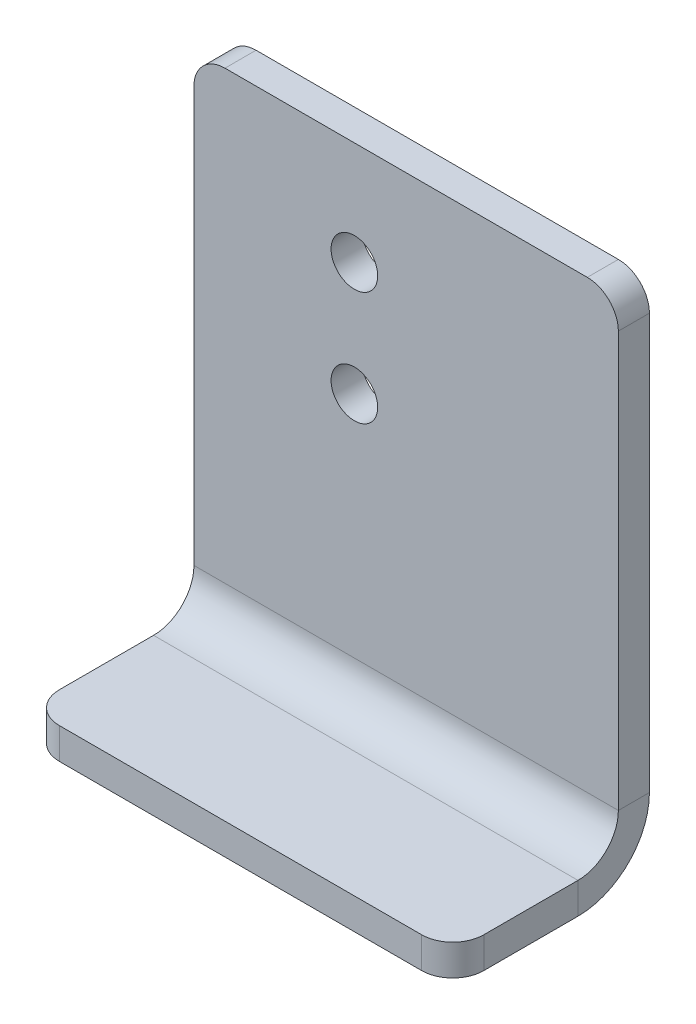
ISO-10303-21;
HEADER;
FILE_DESCRIPTION(('STEP AP214'),'2;1');
FILE_NAME('part.step','',(''),(''),'','','');
FILE_SCHEMA(('AUTOMOTIVE_DESIGN { 1 0 10303 214 1 1 1 1 }'));
ENDSEC;
DATA;
#1=APPLICATION_CONTEXT('core data for automotive mechanical design processes');
#2=APPLICATION_PROTOCOL_DEFINITION('international standard','automotive_design',2000,#1);
#3=PRODUCT_CONTEXT('',#1,'mechanical');
#4=PRODUCT('Part','Part','',(#3));
#5=PRODUCT_RELATED_PRODUCT_CATEGORY('part','',(#4));
#6=PRODUCT_DEFINITION_FORMATION('','',#4);
#7=PRODUCT_DEFINITION_CONTEXT('part definition',#1,'design');
#8=PRODUCT_DEFINITION('design','',#6,#7);
#9=PRODUCT_DEFINITION_SHAPE('','',#8);
#10=(LENGTH_UNIT() NAMED_UNIT(*) SI_UNIT(.MILLI.,.METRE.));
#11=(NAMED_UNIT(*) PLANE_ANGLE_UNIT() SI_UNIT($,.RADIAN.));
#12=(NAMED_UNIT(*) SI_UNIT($,.STERADIAN.) SOLID_ANGLE_UNIT());
#13=UNCERTAINTY_MEASURE_WITH_UNIT(LENGTH_MEASURE(1.E-05),#10,'distance_accuracy_value','');
#14=(GEOMETRIC_REPRESENTATION_CONTEXT(3) GLOBAL_UNCERTAINTY_ASSIGNED_CONTEXT((#13)) GLOBAL_UNIT_ASSIGNED_CONTEXT((#10,
#11,#12)) REPRESENTATION_CONTEXT('',''));
#15=CARTESIAN_POINT('',(0.,0.,0.));
#16=DIRECTION('',(0.,0.,1.));
#17=DIRECTION('',(1.,0.,0.));
#18=AXIS2_PLACEMENT_3D('',#15,#16,#17);
#19=CARTESIAN_POINT('',(20.5,-25.,-3.));
#20=DIRECTION('',(1.,0.,0.));
#21=DIRECTION('',(0.,0.,-1.));
#22=AXIS2_PLACEMENT_3D('',#19,#20,#21);
#23=PLANE('',#22);
#24=DIRECTION('',(0.,1.,0.));
#25=VECTOR('',#24,1.);
#26=CARTESIAN_POINT('',(20.5,-25.,-3.));
#27=LINE('',#26,#25);
#28=CARTESIAN_POINT('',(20.5,-18.1,-3.));
#29=VERTEX_POINT('',#28);
#30=CARTESIAN_POINT('',(20.5,22.,-3.));
#31=VERTEX_POINT('',#30);
#32=EDGE_CURVE('E212',#29,#31,#27,.T.);
#33=ORIENTED_EDGE('',*,*,#32,.T.);
#34=DIRECTION('',(0.,0.,1.));
#35=VECTOR('',#34,1.);
#36=CARTESIAN_POINT('',(20.5,22.,-3.));
#37=LINE('',#36,#35);
#38=CARTESIAN_POINT('',(20.5,22.,0.));
#39=VERTEX_POINT('',#38);
#40=EDGE_CURVE('E13',#31,#39,#37,.T.);
#41=ORIENTED_EDGE('',*,*,#40,.T.);
#42=DIRECTION('',(0.,1.,0.));
#43=VECTOR('',#42,1.);
#44=CARTESIAN_POINT('',(20.5,-25.,0.));
#45=LINE('',#44,#43);
#46=CARTESIAN_POINT('',(20.5,-18.1,0.));
#47=VERTEX_POINT('',#46);
#48=EDGE_CURVE('E221',#47,#39,#45,.T.);
#49=ORIENTED_EDGE('',*,*,#48,.F.);
#50=DIRECTION('',(0.,0.,-1.));
#51=VECTOR('',#50,1.);
#52=CARTESIAN_POINT('',(20.5,-18.1,0.));
#53=LINE('',#52,#51);
#54=EDGE_CURVE('E196',#47,#29,#53,.T.);
#55=ORIENTED_EDGE('',*,*,#54,.T.);
#56=EDGE_LOOP('',(#33,#41,#49,#55));
#57=FACE_BOUND('',#56,.T.);
#58=ADVANCED_FACE('F54',(#57),#23,.T.);
#59=CARTESIAN_POINT('',(0.,0.,-3.));
#60=DIRECTION('',(0.,0.,1.));
#61=DIRECTION('',(1.,0.,0.));
#62=AXIS2_PLACEMENT_3D('',#59,#60,#61);
#63=PLANE('',#62);
#64=CARTESIAN_POINT('',(-5.00000000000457,15.0000000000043,-3.));
#65=DIRECTION('',(0.,0.,-1.));
#66=DIRECTION('',(-1.,0.,0.));
#67=AXIS2_PLACEMENT_3D('',#64,#65,#66);
#68=CIRCLE('',#67,2.25);
#69=CARTESIAN_POINT('',(-7.25000000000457,15.0000000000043,-3.));
#70=VERTEX_POINT('',#69);
#71=EDGE_CURVE('E500',#70,#70,#68,.T.);
#72=ORIENTED_EDGE('',*,*,#71,.F.);
#73=EDGE_LOOP('',(#72));
#74=FACE_BOUND('',#73,.T.);
#75=CARTESIAN_POINT('',(-5.0000000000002,4.,-3.));
#76=DIRECTION('',(0.,0.,-1.));
#77=DIRECTION('',(-1.,0.,0.));
#78=AXIS2_PLACEMENT_3D('',#75,#76,#77);
#79=CIRCLE('',#78,2.25);
#80=CARTESIAN_POINT('',(-7.2500000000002,4.,-3.));
#81=VERTEX_POINT('',#80);
#82=EDGE_CURVE('E501',#81,#81,#79,.T.);
#83=ORIENTED_EDGE('',*,*,#82,.F.);
#84=EDGE_LOOP('',(#83));
#85=FACE_BOUND('',#84,.T.);
#86=DIRECTION('',(0.,-1.,0.));
#87=VECTOR('',#86,1.);
#88=CARTESIAN_POINT('',(-20.5,-25.,-3.));
#89=LINE('',#88,#87);
#90=CARTESIAN_POINT('',(-20.5,22.,-3.));
#91=VERTEX_POINT('',#90);
#92=CARTESIAN_POINT('',(-20.5,-18.1,-3.));
#93=VERTEX_POINT('',#92);
#94=EDGE_CURVE('E210',#91,#93,#89,.T.);
#95=ORIENTED_EDGE('',*,*,#94,.F.);
#96=CARTESIAN_POINT('',(-17.5,22.,-3.));
#97=DIRECTION('',(0.,0.,1.));
#98=DIRECTION('',(1.,0.,0.));
#99=AXIS2_PLACEMENT_3D('',#96,#97,#98);
#100=CIRCLE('',#99,3.);
#101=CARTESIAN_POINT('',(-17.5,25.,-3.));
#102=VERTEX_POINT('',#101);
#103=EDGE_CURVE('E238',#91,#102,#100,.F.);
#104=ORIENTED_EDGE('',*,*,#103,.T.);
#105=DIRECTION('',(-1.,0.,0.));
#106=VECTOR('',#105,1.);
#107=CARTESIAN_POINT('',(20.5,25.,-3.));
#108=LINE('',#107,#106);
#109=CARTESIAN_POINT('',(17.5,25.,-3.));
#110=VERTEX_POINT('',#109);
#111=EDGE_CURVE('E216',#110,#102,#108,.T.);
#112=ORIENTED_EDGE('',*,*,#111,.F.);
#113=CARTESIAN_POINT('',(17.5,22.,-3.));
#114=DIRECTION('',(0.,0.,1.));
#115=DIRECTION('',(1.,0.,0.));
#116=AXIS2_PLACEMENT_3D('',#113,#114,#115);
#117=CIRCLE('',#116,3.);
#118=EDGE_CURVE('E236',#110,#31,#117,.F.);
#119=ORIENTED_EDGE('',*,*,#118,.T.);
#120=ORIENTED_EDGE('',*,*,#32,.F.);
#121=DIRECTION('',(1.,0.,0.));
#122=VECTOR('',#121,1.);
#123=CARTESIAN_POINT('',(20.5,-18.1,-3.));
#124=LINE('',#123,#122);
#125=EDGE_CURVE('E155',#29,#93,#124,.F.);
#126=ORIENTED_EDGE('',*,*,#125,.T.);
#127=EDGE_LOOP('',(#95,#104,#112,#119,#120,#126));
#128=FACE_BOUND('',#127,.T.);
#129=ADVANCED_FACE('F283',(#74,#85,#128),#63,.F.);
#130=CARTESIAN_POINT('',(0.,0.,0.));
#131=DIRECTION('',(0.,0.,1.));
#132=DIRECTION('',(1.,0.,0.));
#133=AXIS2_PLACEMENT_3D('',#130,#131,#132);
#134=PLANE('',#133);
#135=CARTESIAN_POINT('',(-5.00000000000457,15.0000000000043,0.));
#136=DIRECTION('',(0.,0.,1.));
#137=DIRECTION('',(1.,0.,0.));
#138=AXIS2_PLACEMENT_3D('',#135,#136,#137);
#139=CIRCLE('',#138,2.25);
#140=CARTESIAN_POINT('',(-2.75000000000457,15.0000000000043,0.));
#141=VERTEX_POINT('',#140);
#142=EDGE_CURVE('E193',#141,#141,#139,.F.);
#143=ORIENTED_EDGE('',*,*,#142,.T.);
#144=EDGE_LOOP('',(#143));
#145=FACE_BOUND('',#144,.T.);
#146=CARTESIAN_POINT('',(-5.0000000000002,4.,0.));
#147=DIRECTION('',(0.,0.,1.));
#148=DIRECTION('',(1.,0.,0.));
#149=AXIS2_PLACEMENT_3D('',#146,#147,#148);
#150=CIRCLE('',#149,2.25);
#151=CARTESIAN_POINT('',(-2.7500000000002,4.,0.));
#152=VERTEX_POINT('',#151);
#153=EDGE_CURVE('E498',#152,#152,#150,.F.);
#154=ORIENTED_EDGE('',*,*,#153,.T.);
#155=EDGE_LOOP('',(#154));
#156=FACE_BOUND('',#155,.T.);
#157=DIRECTION('',(-1.,0.,0.));
#158=VECTOR('',#157,1.);
#159=CARTESIAN_POINT('',(20.5,25.,0.));
#160=LINE('',#159,#158);
#161=CARTESIAN_POINT('',(17.5,25.,0.));
#162=VERTEX_POINT('',#161);
#163=CARTESIAN_POINT('',(-17.5,25.,0.));
#164=VERTEX_POINT('',#163);
#165=EDGE_CURVE('E213',#162,#164,#160,.T.);
#166=ORIENTED_EDGE('',*,*,#165,.T.);
#167=CARTESIAN_POINT('',(-17.5,22.,0.));
#168=DIRECTION('',(0.,0.,1.));
#169=DIRECTION('',(1.,0.,0.));
#170=AXIS2_PLACEMENT_3D('',#167,#168,#169);
#171=CIRCLE('',#170,3.);
#172=CARTESIAN_POINT('',(-20.5,22.,0.));
#173=VERTEX_POINT('',#172);
#174=EDGE_CURVE('E232',#164,#173,#171,.T.);
#175=ORIENTED_EDGE('',*,*,#174,.T.);
#176=DIRECTION('',(0.,-1.,0.));
#177=VECTOR('',#176,1.);
#178=CARTESIAN_POINT('',(-20.5,-25.,0.));
#179=LINE('',#178,#177);
#180=CARTESIAN_POINT('',(-20.5,-18.1,0.));
#181=VERTEX_POINT('',#180);
#182=EDGE_CURVE('E207',#173,#181,#179,.T.);
#183=ORIENTED_EDGE('',*,*,#182,.T.);
#184=DIRECTION('',(1.,0.,0.));
#185=VECTOR('',#184,1.);
#186=CARTESIAN_POINT('',(20.5,-18.1,0.));
#187=LINE('',#186,#185);
#188=EDGE_CURVE('E200',#47,#181,#187,.F.);
#189=ORIENTED_EDGE('',*,*,#188,.F.);
#190=ORIENTED_EDGE('',*,*,#48,.T.);
#191=CARTESIAN_POINT('',(17.5,22.,0.));
#192=DIRECTION('',(0.,0.,1.));
#193=DIRECTION('',(1.,0.,0.));
#194=AXIS2_PLACEMENT_3D('',#191,#192,#193);
#195=CIRCLE('',#194,3.);
#196=EDGE_CURVE('E230',#39,#162,#195,.T.);
#197=ORIENTED_EDGE('',*,*,#196,.T.);
#198=EDGE_LOOP('',(#166,#175,#183,#189,#190,#197));
#199=FACE_BOUND('',#198,.T.);
#200=ADVANCED_FACE('F290',(#145,#156,#199),#134,.T.);
#201=CARTESIAN_POINT('',(-20.5,-25.,-3.));
#202=DIRECTION('',(-1.,0.,0.));
#203=DIRECTION('',(0.,0.,1.));
#204=AXIS2_PLACEMENT_3D('',#201,#202,#203);
#205=PLANE('',#204);
#206=ORIENTED_EDGE('',*,*,#182,.F.);
#207=DIRECTION('',(0.,0.,1.));
#208=VECTOR('',#207,1.);
#209=CARTESIAN_POINT('',(-20.5,22.,-3.));
#210=LINE('',#209,#208);
#211=EDGE_CURVE('E234',#173,#91,#210,.F.);
#212=ORIENTED_EDGE('',*,*,#211,.T.);
#213=ORIENTED_EDGE('',*,*,#94,.T.);
#214=DIRECTION('',(0.,0.,-1.));
#215=VECTOR('',#214,1.);
#216=CARTESIAN_POINT('',(-20.5,-18.1,0.));
#217=LINE('',#216,#215);
#218=EDGE_CURVE('E204',#181,#93,#217,.T.);
#219=ORIENTED_EDGE('',*,*,#218,.F.);
#220=EDGE_LOOP('',(#206,#212,#213,#219));
#221=FACE_BOUND('',#220,.T.);
#222=ADVANCED_FACE('F278',(#221),#205,.T.);
#223=CARTESIAN_POINT('',(20.5,25.,-3.));
#224=DIRECTION('',(0.,1.,0.));
#225=DIRECTION('',(-1.,0.,0.));
#226=AXIS2_PLACEMENT_3D('',#223,#224,#225);
#227=PLANE('',#226);
#228=ORIENTED_EDGE('',*,*,#111,.T.);
#229=DIRECTION('',(0.,0.,1.));
#230=VECTOR('',#229,1.);
#231=CARTESIAN_POINT('',(-17.5,25.,-3.));
#232=LINE('',#231,#230);
#233=EDGE_CURVE('E227',#102,#164,#232,.T.);
#234=ORIENTED_EDGE('',*,*,#233,.T.);
#235=ORIENTED_EDGE('',*,*,#165,.F.);
#236=DIRECTION('',(0.,0.,1.));
#237=VECTOR('',#236,1.);
#238=CARTESIAN_POINT('',(17.5,25.,-3.));
#239=LINE('',#238,#237);
#240=EDGE_CURVE('E219',#162,#110,#239,.F.);
#241=ORIENTED_EDGE('',*,*,#240,.T.);
#242=EDGE_LOOP('',(#228,#234,#235,#241));
#243=FACE_BOUND('',#242,.T.);
#244=ADVANCED_FACE('F296',(#243),#227,.T.);
#245=CARTESIAN_POINT('',(-20.5,-18.1,3.9));
#246=DIRECTION('',(-1.,0.,0.));
#247=DIRECTION('',(0.,0.,1.));
#248=AXIS2_PLACEMENT_3D('',#245,#246,#247);
#249=PLANE('',#248);
#250=DIRECTION('',(0.,1.,0.));
#251=VECTOR('',#250,1.);
#252=CARTESIAN_POINT('',(-20.5,-25.,3.89999999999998));
#253=LINE('',#252,#251);
#254=CARTESIAN_POINT('',(-20.5,-22.,3.89999999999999));
#255=VERTEX_POINT('',#254);
#256=CARTESIAN_POINT('',(-20.5,-25.,3.89999999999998));
#257=VERTEX_POINT('',#256);
#258=EDGE_CURVE('E190',#255,#257,#253,.F.);
#259=ORIENTED_EDGE('',*,*,#258,.F.);
#260=CARTESIAN_POINT('',(-20.5,-18.1,3.9));
#261=DIRECTION('',(1.,0.,0.));
#262=DIRECTION('',(0.,0.,-1.));
#263=AXIS2_PLACEMENT_3D('',#260,#261,#262);
#264=CIRCLE('',#263,3.9);
#265=EDGE_CURVE('E158',#181,#255,#264,.F.);
#266=ORIENTED_EDGE('',*,*,#265,.F.);
#267=ORIENTED_EDGE('',*,*,#218,.T.);
#268=CARTESIAN_POINT('',(-20.5,-18.1,3.9));
#269=DIRECTION('',(1.,0.,0.));
#270=DIRECTION('',(0.,0.,-1.));
#271=AXIS2_PLACEMENT_3D('',#268,#269,#270);
#272=CIRCLE('',#271,6.9);
#273=EDGE_CURVE('E195',#93,#257,#272,.F.);
#274=ORIENTED_EDGE('',*,*,#273,.T.);
#275=EDGE_LOOP('',(#259,#266,#267,#274));
#276=FACE_BOUND('',#275,.T.);
#277=ADVANCED_FACE('F274',(#276),#249,.T.);
#278=CARTESIAN_POINT('',(20.5,-18.1,3.9));
#279=DIRECTION('',(-1.,0.,0.));
#280=DIRECTION('',(0.,0.,1.));
#281=AXIS2_PLACEMENT_3D('',#278,#279,#280);
#282=PLANE('',#281);
#283=CARTESIAN_POINT('',(20.5,-18.1,3.9));
#284=DIRECTION('',(1.,0.,0.));
#285=DIRECTION('',(0.,0.,-1.));
#286=AXIS2_PLACEMENT_3D('',#283,#284,#285);
#287=CIRCLE('',#286,3.9);
#288=CARTESIAN_POINT('',(20.5,-22.,3.89999999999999));
#289=VERTEX_POINT('',#288);
#290=EDGE_CURVE('E165',#289,#47,#287,.T.);
#291=ORIENTED_EDGE('',*,*,#290,.F.);
#292=DIRECTION('',(0.,1.,0.));
#293=VECTOR('',#292,1.);
#294=CARTESIAN_POINT('',(20.5,-22.,3.89999999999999));
#295=LINE('',#294,#293);
#296=CARTESIAN_POINT('',(20.5,-25.,3.89999999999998));
#297=VERTEX_POINT('',#296);
#298=EDGE_CURVE('E162',#289,#297,#295,.F.);
#299=ORIENTED_EDGE('',*,*,#298,.T.);
#300=CARTESIAN_POINT('',(20.5,-18.1,3.9));
#301=DIRECTION('',(1.,0.,0.));
#302=DIRECTION('',(0.,0.,-1.));
#303=AXIS2_PLACEMENT_3D('',#300,#301,#302);
#304=CIRCLE('',#303,6.9);
#305=EDGE_CURVE('E147',#297,#29,#304,.T.);
#306=ORIENTED_EDGE('',*,*,#305,.T.);
#307=ORIENTED_EDGE('',*,*,#54,.F.);
#308=EDGE_LOOP('',(#291,#299,#306,#307));
#309=FACE_BOUND('',#308,.T.);
#310=ADVANCED_FACE('F163',(#309),#282,.F.);
#311=CARTESIAN_POINT('',(20.5,-18.1,3.9));
#312=DIRECTION('',(1.,0.,0.));
#313=DIRECTION('',(0.,-1.,0.));
#314=AXIS2_PLACEMENT_3D('',#311,#312,#313);
#315=CYLINDRICAL_SURFACE('',#314,6.9);
#316=ORIENTED_EDGE('',*,*,#125,.F.);
#317=ORIENTED_EDGE('',*,*,#305,.F.);
#318=DIRECTION('',(1.,0.,0.));
#319=VECTOR('',#318,1.);
#320=CARTESIAN_POINT('',(-20.5,-25.,3.89999999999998));
#321=LINE('',#320,#319);
#322=EDGE_CURVE('E152',#297,#257,#321,.F.);
#323=ORIENTED_EDGE('',*,*,#322,.T.);
#324=ORIENTED_EDGE('',*,*,#273,.F.);
#325=EDGE_LOOP('',(#316,#317,#323,#324));
#326=FACE_BOUND('',#325,.T.);
#327=ADVANCED_FACE('F149',(#326),#315,.T.);
#328=CARTESIAN_POINT('',(20.5,-18.1,3.9));
#329=DIRECTION('',(1.,0.,0.));
#330=DIRECTION('',(0.,-1.,0.));
#331=AXIS2_PLACEMENT_3D('',#328,#329,#330);
#332=CYLINDRICAL_SURFACE('',#331,3.9);
#333=ORIENTED_EDGE('',*,*,#188,.T.);
#334=ORIENTED_EDGE('',*,*,#265,.T.);
#335=DIRECTION('',(1.,0.,0.));
#336=VECTOR('',#335,1.);
#337=CARTESIAN_POINT('',(-20.5,-22.,3.89999999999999));
#338=LINE('',#337,#336);
#339=EDGE_CURVE('E167',#255,#289,#338,.T.);
#340=ORIENTED_EDGE('',*,*,#339,.T.);
#341=ORIENTED_EDGE('',*,*,#290,.T.);
#342=EDGE_LOOP('',(#333,#334,#340,#341));
#343=FACE_BOUND('',#342,.T.);
#344=ADVANCED_FACE('F271',(#343),#332,.F.);
#345=CARTESIAN_POINT('',(-20.5,-25.,0.));
#346=DIRECTION('',(1.,0.,0.));
#347=DIRECTION('',(0.,1.,0.));
#348=AXIS2_PLACEMENT_3D('',#345,#346,#347);
#349=PLANE('',#348);
#350=DIRECTION('',(0.,0.,-1.));
#351=VECTOR('',#350,1.);
#352=CARTESIAN_POINT('',(-20.5,-25.,0.));
#353=LINE('',#352,#351);
#354=CARTESIAN_POINT('',(-20.5,-25.,13.));
#355=VERTEX_POINT('',#354);
#356=EDGE_CURVE('E174',#355,#257,#353,.T.);
#357=ORIENTED_EDGE('',*,*,#356,.F.);
#358=DIRECTION('',(0.,1.,0.));
#359=VECTOR('',#358,1.);
#360=CARTESIAN_POINT('',(-20.5,-25.,13.));
#361=LINE('',#360,#359);
#362=CARTESIAN_POINT('',(-20.5,-22.,13.));
#363=VERTEX_POINT('',#362);
#364=EDGE_CURVE('E240',#355,#363,#361,.T.);
#365=ORIENTED_EDGE('',*,*,#364,.T.);
#366=DIRECTION('',(0.,0.,1.));
#367=VECTOR('',#366,1.);
#368=CARTESIAN_POINT('',(-20.5,-22.,0.));
#369=LINE('',#368,#367);
#370=EDGE_CURVE('E175',#363,#255,#369,.F.);
#371=ORIENTED_EDGE('',*,*,#370,.T.);
#372=ORIENTED_EDGE('',*,*,#258,.T.);
#373=EDGE_LOOP('',(#357,#365,#371,#372));
#374=FACE_BOUND('',#373,.T.);
#375=ADVANCED_FACE('F258',(#374),#349,.F.);
#376=CARTESIAN_POINT('',(20.5,-25.0000000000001,16.));
#377=DIRECTION('',(-1.,0.,0.));
#378=DIRECTION('',(0.,0.,1.));
#379=AXIS2_PLACEMENT_3D('',#376,#377,#378);
#380=PLANE('',#379);
#381=DIRECTION('',(0.,0.,-1.));
#382=VECTOR('',#381,1.);
#383=CARTESIAN_POINT('',(20.5,-22.0000000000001,16.));
#384=LINE('',#383,#382);
#385=CARTESIAN_POINT('',(20.5,-22.,13.));
#386=VERTEX_POINT('',#385);
#387=EDGE_CURVE('E186',#289,#386,#384,.F.);
#388=ORIENTED_EDGE('',*,*,#387,.T.);
#389=DIRECTION('',(0.,1.,0.));
#390=VECTOR('',#389,1.);
#391=CARTESIAN_POINT('',(20.5,-25.,13.));
#392=LINE('',#391,#390);
#393=CARTESIAN_POINT('',(20.5,-25.,13.));
#394=VERTEX_POINT('',#393);
#395=EDGE_CURVE('E62',#386,#394,#392,.F.);
#396=ORIENTED_EDGE('',*,*,#395,.T.);
#397=DIRECTION('',(0.,0.,1.));
#398=VECTOR('',#397,1.);
#399=CARTESIAN_POINT('',(20.5,-25.,0.));
#400=LINE('',#399,#398);
#401=EDGE_CURVE('E171',#297,#394,#400,.T.);
#402=ORIENTED_EDGE('',*,*,#401,.F.);
#403=ORIENTED_EDGE('',*,*,#298,.F.);
#404=EDGE_LOOP('',(#388,#396,#402,#403));
#405=FACE_BOUND('',#404,.T.);
#406=ADVANCED_FACE('F177',(#405),#380,.F.);
#407=CARTESIAN_POINT('',(0.,-25.,0.));
#408=DIRECTION('',(0.,1.,0.));
#409=DIRECTION('',(0.,0.,1.));
#410=AXIS2_PLACEMENT_3D('',#407,#408,#409);
#411=PLANE('',#410);
#412=DIRECTION('',(-1.,0.,0.));
#413=VECTOR('',#412,1.);
#414=CARTESIAN_POINT('',(0.,-25.0000000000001,16.));
#415=LINE('',#414,#413);
#416=CARTESIAN_POINT('',(17.5,-25.0000000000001,16.));
#417=VERTEX_POINT('',#416);
#418=CARTESIAN_POINT('',(-17.5,-25.0000000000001,16.));
#419=VERTEX_POINT('',#418);
#420=EDGE_CURVE('E178',#417,#419,#415,.T.);
#421=ORIENTED_EDGE('',*,*,#420,.T.);
#422=CARTESIAN_POINT('',(-17.5,-25.,13.));
#423=DIRECTION('',(0.,1.,0.));
#424=DIRECTION('',(0.,0.,1.));
#425=AXIS2_PLACEMENT_3D('',#422,#423,#424);
#426=CIRCLE('',#425,3.);
#427=EDGE_CURVE('E253',#419,#355,#426,.F.);
#428=ORIENTED_EDGE('',*,*,#427,.T.);
#429=ORIENTED_EDGE('',*,*,#356,.T.);
#430=ORIENTED_EDGE('',*,*,#322,.F.);
#431=ORIENTED_EDGE('',*,*,#401,.T.);
#432=CARTESIAN_POINT('',(17.5,-25.,13.));
#433=DIRECTION('',(0.,1.,0.));
#434=DIRECTION('',(0.,0.,1.));
#435=AXIS2_PLACEMENT_3D('',#432,#433,#434);
#436=CIRCLE('',#435,3.);
#437=EDGE_CURVE('E251',#394,#417,#436,.F.);
#438=ORIENTED_EDGE('',*,*,#437,.T.);
#439=EDGE_LOOP('',(#421,#428,#429,#430,#431,#438));
#440=FACE_BOUND('',#439,.T.);
#441=ADVANCED_FACE('F170',(#440),#411,.F.);
#442=CARTESIAN_POINT('',(0.,-22.,0.));
#443=DIRECTION('',(0.,1.,0.));
#444=DIRECTION('',(0.,0.,1.));
#445=AXIS2_PLACEMENT_3D('',#442,#443,#444);
#446=PLANE('',#445);
#447=ORIENTED_EDGE('',*,*,#370,.F.);
#448=CARTESIAN_POINT('',(-17.5,-22.,13.));
#449=DIRECTION('',(0.,1.,0.));
#450=DIRECTION('',(0.,0.,1.));
#451=AXIS2_PLACEMENT_3D('',#448,#449,#450);
#452=CIRCLE('',#451,3.);
#453=CARTESIAN_POINT('',(-17.5,-22.0000000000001,16.));
#454=VERTEX_POINT('',#453);
#455=EDGE_CURVE('E245',#363,#454,#452,.T.);
#456=ORIENTED_EDGE('',*,*,#455,.T.);
#457=DIRECTION('',(1.,0.,0.));
#458=VECTOR('',#457,1.);
#459=CARTESIAN_POINT('',(-20.5,-22.0000000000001,16.));
#460=LINE('',#459,#458);
#461=CARTESIAN_POINT('',(17.5,-22.0000000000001,16.));
#462=VERTEX_POINT('',#461);
#463=EDGE_CURVE('E181',#462,#454,#460,.F.);
#464=ORIENTED_EDGE('',*,*,#463,.F.);
#465=CARTESIAN_POINT('',(17.5,-22.,13.));
#466=DIRECTION('',(0.,1.,0.));
#467=DIRECTION('',(0.,0.,1.));
#468=AXIS2_PLACEMENT_3D('',#465,#466,#467);
#469=CIRCLE('',#468,3.);
#470=EDGE_CURVE('E243',#462,#386,#469,.T.);
#471=ORIENTED_EDGE('',*,*,#470,.T.);
#472=ORIENTED_EDGE('',*,*,#387,.F.);
#473=ORIENTED_EDGE('',*,*,#339,.F.);
#474=EDGE_LOOP('',(#447,#456,#464,#471,#472,#473));
#475=FACE_BOUND('',#474,.T.);
#476=ADVANCED_FACE('F264',(#475),#446,.T.);
#477=CARTESIAN_POINT('',(-20.5,-25.0000000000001,16.));
#478=DIRECTION('',(0.,0.,-1.));
#479=DIRECTION('',(0.,1.,0.));
#480=AXIS2_PLACEMENT_3D('',#477,#478,#479);
#481=PLANE('',#480);
#482=ORIENTED_EDGE('',*,*,#463,.T.);
#483=DIRECTION('',(0.,1.,0.));
#484=VECTOR('',#483,1.);
#485=CARTESIAN_POINT('',(-17.5,-25.0000000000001,16.));
#486=LINE('',#485,#484);
#487=EDGE_CURVE('E76',#454,#419,#486,.F.);
#488=ORIENTED_EDGE('',*,*,#487,.T.);
#489=ORIENTED_EDGE('',*,*,#420,.F.);
#490=DIRECTION('',(0.,1.,0.));
#491=VECTOR('',#490,1.);
#492=CARTESIAN_POINT('',(17.5,-25.0000000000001,16.));
#493=LINE('',#492,#491);
#494=EDGE_CURVE('E247',#417,#462,#493,.T.);
#495=ORIENTED_EDGE('',*,*,#494,.T.);
#496=EDGE_LOOP('',(#482,#488,#489,#495));
#497=FACE_BOUND('',#496,.T.);
#498=ADVANCED_FACE('F266',(#497),#481,.F.);
#499=CARTESIAN_POINT('',(-5.0000000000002,4.,6.36396103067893));
#500=DIRECTION('',(0.,0.,-1.));
#501=DIRECTION('',(-1.,0.,0.));
#502=AXIS2_PLACEMENT_3D('',#499,#500,#501);
#503=CYLINDRICAL_SURFACE('',#502,2.25);
#504=ORIENTED_EDGE('',*,*,#82,.T.);
#505=EDGE_LOOP('',(#504));
#506=FACE_BOUND('',#505,.T.);
#507=ORIENTED_EDGE('',*,*,#153,.F.);
#508=EDGE_LOOP('',(#507));
#509=FACE_BOUND('',#508,.T.);
#510=ADVANCED_FACE('F349',(#506,#509),#503,.F.);
#511=CARTESIAN_POINT('',(-5.00000000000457,15.0000000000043,6.36396103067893));
#512=DIRECTION('',(0.,0.,-1.));
#513=DIRECTION('',(-1.,0.,0.));
#514=AXIS2_PLACEMENT_3D('',#511,#512,#513);
#515=CYLINDRICAL_SURFACE('',#514,2.25);
#516=ORIENTED_EDGE('',*,*,#71,.T.);
#517=EDGE_LOOP('',(#516));
#518=FACE_BOUND('',#517,.T.);
#519=ORIENTED_EDGE('',*,*,#142,.F.);
#520=EDGE_LOOP('',(#519));
#521=FACE_BOUND('',#520,.T.);
#522=ADVANCED_FACE('F318',(#518,#521),#515,.F.);
#523=CARTESIAN_POINT('',(-17.5,22.,-3.));
#524=DIRECTION('',(0.,0.,1.));
#525=DIRECTION('',(1.,0.,0.));
#526=AXIS2_PLACEMENT_3D('',#523,#524,#525);
#527=CYLINDRICAL_SURFACE('',#526,3.);
#528=ORIENTED_EDGE('',*,*,#103,.F.);
#529=ORIENTED_EDGE('',*,*,#211,.F.);
#530=ORIENTED_EDGE('',*,*,#174,.F.);
#531=ORIENTED_EDGE('',*,*,#233,.F.);
#532=EDGE_LOOP('',(#528,#529,#530,#531));
#533=FACE_BOUND('',#532,.T.);
#534=ADVANCED_FACE('F294',(#533),#527,.T.);
#535=CARTESIAN_POINT('',(-17.5,-25.,13.));
#536=DIRECTION('',(0.,1.,0.));
#537=DIRECTION('',(0.,0.,1.));
#538=AXIS2_PLACEMENT_3D('',#535,#536,#537);
#539=CYLINDRICAL_SURFACE('',#538,3.);
#540=ORIENTED_EDGE('',*,*,#427,.F.);
#541=ORIENTED_EDGE('',*,*,#487,.F.);
#542=ORIENTED_EDGE('',*,*,#455,.F.);
#543=ORIENTED_EDGE('',*,*,#364,.F.);
#544=EDGE_LOOP('',(#540,#541,#542,#543));
#545=FACE_BOUND('',#544,.T.);
#546=ADVANCED_FACE('F261',(#545),#539,.T.);
#547=CARTESIAN_POINT('',(17.5,-25.,13.));
#548=DIRECTION('',(0.,1.,0.));
#549=DIRECTION('',(0.,0.,1.));
#550=AXIS2_PLACEMENT_3D('',#547,#548,#549);
#551=CYLINDRICAL_SURFACE('',#550,3.);
#552=ORIENTED_EDGE('',*,*,#437,.F.);
#553=ORIENTED_EDGE('',*,*,#395,.F.);
#554=ORIENTED_EDGE('',*,*,#470,.F.);
#555=ORIENTED_EDGE('',*,*,#494,.F.);
#556=EDGE_LOOP('',(#552,#553,#554,#555));
#557=FACE_BOUND('',#556,.T.);
#558=ADVANCED_FACE('F269',(#557),#551,.T.);
#559=CARTESIAN_POINT('',(17.5,22.,-3.));
#560=DIRECTION('',(0.,0.,1.));
#561=DIRECTION('',(1.,0.,0.));
#562=AXIS2_PLACEMENT_3D('',#559,#560,#561);
#563=CYLINDRICAL_SURFACE('',#562,3.);
#564=ORIENTED_EDGE('',*,*,#118,.F.);
#565=ORIENTED_EDGE('',*,*,#240,.F.);
#566=ORIENTED_EDGE('',*,*,#196,.F.);
#567=ORIENTED_EDGE('',*,*,#40,.F.);
#568=EDGE_LOOP('',(#564,#565,#566,#567));
#569=FACE_BOUND('',#568,.T.);
#570=ADVANCED_FACE('F56',(#569),#563,.T.);
#571=CLOSED_SHELL('',(#58,#129,#200,#222,#244,#277,#310,#327,#344,#375,#406,#441,#476,#498,#510,
#522,#534,#546,#558,#570));
#572=MANIFOLD_SOLID_BREP('B2',#571);
#573=ADVANCED_BREP_SHAPE_REPRESENTATION('',(#18,#572),#14);
#574=SHAPE_DEFINITION_REPRESENTATION(#9,#573);
ENDSEC;
END-ISO-10303-21;
